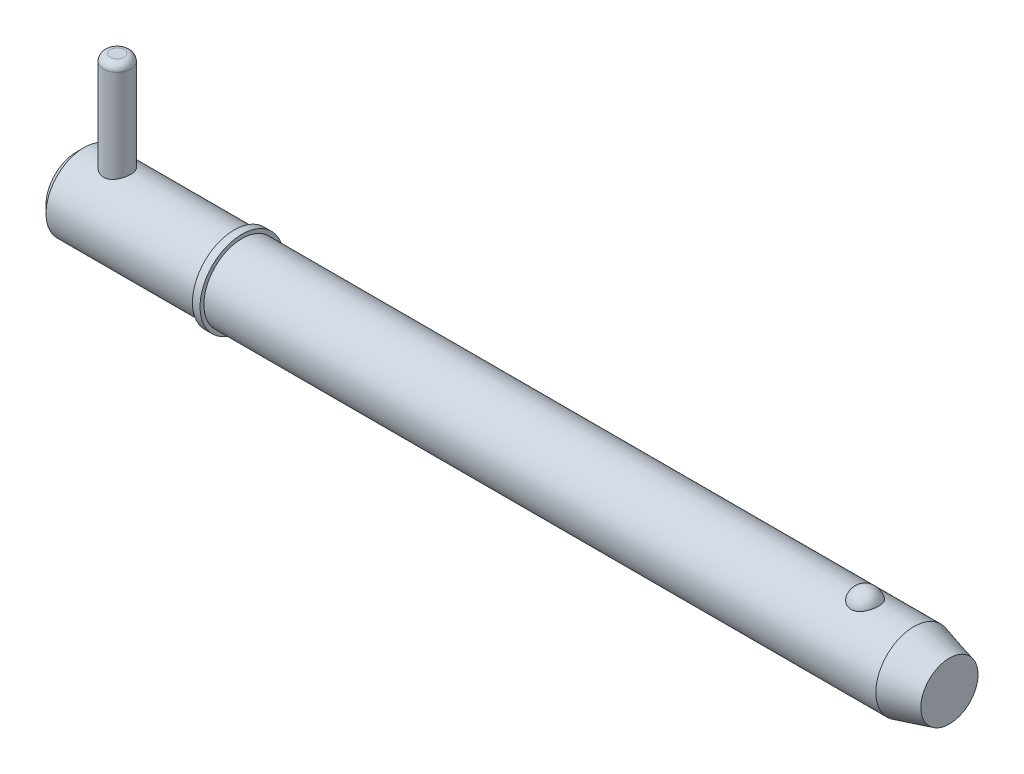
ISO-10303-21;
HEADER;
FILE_DESCRIPTION(('STEP AP214'),'2;1');
FILE_NAME('part.step','',(''),(''),'','','');
FILE_SCHEMA(('AUTOMOTIVE_DESIGN { 1 0 10303 214 1 1 1 1 }'));
ENDSEC;
DATA;
#1=APPLICATION_CONTEXT('core data for automotive mechanical design processes');
#2=APPLICATION_PROTOCOL_DEFINITION('international standard','automotive_design',2000,#1);
#3=PRODUCT_CONTEXT('',#1,'mechanical');
#4=PRODUCT('Part','Part','',(#3));
#5=PRODUCT_RELATED_PRODUCT_CATEGORY('part','',(#4));
#6=PRODUCT_DEFINITION_FORMATION('','',#4);
#7=PRODUCT_DEFINITION_CONTEXT('part definition',#1,'design');
#8=PRODUCT_DEFINITION('design','',#6,#7);
#9=PRODUCT_DEFINITION_SHAPE('','',#8);
#10=(LENGTH_UNIT() NAMED_UNIT(*) SI_UNIT(.MILLI.,.METRE.));
#11=(NAMED_UNIT(*) PLANE_ANGLE_UNIT() SI_UNIT($,.RADIAN.));
#12=(NAMED_UNIT(*) SI_UNIT($,.STERADIAN.) SOLID_ANGLE_UNIT());
#13=UNCERTAINTY_MEASURE_WITH_UNIT(LENGTH_MEASURE(1.E-05),#10,'distance_accuracy_value','');
#14=(GEOMETRIC_REPRESENTATION_CONTEXT(3) GLOBAL_UNCERTAINTY_ASSIGNED_CONTEXT((#13)) GLOBAL_UNIT_ASSIGNED_CONTEXT((#10,
#11,#12)) REPRESENTATION_CONTEXT('',''));
#15=CARTESIAN_POINT('',(0.,0.,0.));
#16=DIRECTION('',(0.,0.,1.));
#17=DIRECTION('',(1.,0.,0.));
#18=AXIS2_PLACEMENT_3D('',#15,#16,#17);
#19=CARTESIAN_POINT('',(5.94,19.845,0.));
#20=DIRECTION('',(0.,-1.,0.));
#21=DIRECTION('',(0.,0.,-1.));
#22=AXIS2_PLACEMENT_3D('',#19,#20,#21);
#23=CYLINDRICAL_SURFACE('',#22,1.98);
#24=CARTESIAN_POINT('',(5.94,-4.565,0.));
#25=DIRECTION('',(0.,1.,0.));
#26=DIRECTION('',(0.,0.,1.));
#27=AXIS2_PLACEMENT_3D('',#24,#25,#26);
#28=CIRCLE('',#27,1.98);
#29=CARTESIAN_POINT('',(5.94,-4.565,1.98));
#30=VERTEX_POINT('',#29);
#31=EDGE_CURVE('P0_E25',#30,#30,#28,.T.);
#32=ORIENTED_EDGE('',*,*,#31,.T.);
#33=EDGE_LOOP('',(#32));
#34=FACE_BOUND('',#33,.T.);
#35=CARTESIAN_POINT('',(5.94,18.855,0.));
#36=DIRECTION('',(0.,1.,0.));
#37=DIRECTION('',(0.,0.,1.));
#38=AXIS2_PLACEMENT_3D('',#35,#36,#37);
#39=CIRCLE('',#38,1.98);
#40=CARTESIAN_POINT('',(5.94,18.855,1.98));
#41=VERTEX_POINT('',#40);
#42=EDGE_CURVE('P0_E29',#41,#41,#39,.F.);
#43=ORIENTED_EDGE('',*,*,#42,.T.);
#44=EDGE_LOOP('',(#43));
#45=FACE_BOUND('',#44,.T.);
#46=ADVANCED_FACE('P0_F14',(#34,#45),#23,.T.);
#47=CARTESIAN_POINT('',(5.94,19.845,0.));
#48=DIRECTION('',(0.,1.,0.));
#49=DIRECTION('',(0.,0.,1.));
#50=AXIS2_PLACEMENT_3D('',#47,#48,#49);
#51=PLANE('',#50);
#52=CARTESIAN_POINT('',(5.94,19.845,0.));
#53=DIRECTION('',(0.,1.,0.));
#54=DIRECTION('',(0.,0.,1.));
#55=AXIS2_PLACEMENT_3D('',#52,#53,#54);
#56=CIRCLE('',#55,0.99);
#57=CARTESIAN_POINT('',(5.94,19.845,0.99));
#58=VERTEX_POINT('',#57);
#59=EDGE_CURVE('P0_E10',#58,#58,#56,.T.);
#60=ORIENTED_EDGE('',*,*,#59,.T.);
#61=EDGE_LOOP('',(#60));
#62=FACE_BOUND('',#61,.T.);
#63=ADVANCED_FACE('P0_F46',(#62),#51,.T.);
#64=CARTESIAN_POINT('',(5.94,-5.555,0.));
#65=DIRECTION('',(0.,1.,0.));
#66=DIRECTION('',(0.,0.,1.));
#67=AXIS2_PLACEMENT_3D('',#64,#65,#66);
#68=PLANE('',#67);
#69=CARTESIAN_POINT('',(5.94,-5.555,0.));
#70=DIRECTION('',(0.,1.,0.));
#71=DIRECTION('',(0.,0.,1.));
#72=AXIS2_PLACEMENT_3D('',#69,#70,#71);
#73=CIRCLE('',#72,0.99);
#74=CARTESIAN_POINT('',(5.94,-5.555,0.99));
#75=VERTEX_POINT('',#74);
#76=EDGE_CURVE('P0_E21',#75,#75,#73,.F.);
#77=ORIENTED_EDGE('',*,*,#76,.T.);
#78=EDGE_LOOP('',(#77));
#79=FACE_BOUND('',#78,.T.);
#80=ADVANCED_FACE('P0_F43',(#79),#68,.F.);
#81=CARTESIAN_POINT('',(5.94,-4.565,0.));
#82=DIRECTION('',(0.,1.,0.));
#83=DIRECTION('',(0.,0.,1.));
#84=AXIS2_PLACEMENT_3D('',#81,#82,#83);
#85=DEGENERATE_TOROIDAL_SURFACE('',#84,0.99,0.99,.T.);
#86=ORIENTED_EDGE('',*,*,#76,.F.);
#87=EDGE_LOOP('',(#86));
#88=FACE_BOUND('',#87,.T.);
#89=ORIENTED_EDGE('',*,*,#31,.F.);
#90=EDGE_LOOP('',(#89));
#91=FACE_BOUND('',#90,.T.);
#92=ADVANCED_FACE('P0_F38',(#88,#91),#85,.T.);
#93=CARTESIAN_POINT('',(5.94,18.855,0.));
#94=DIRECTION('',(0.,1.,0.));
#95=DIRECTION('',(0.,0.,1.));
#96=AXIS2_PLACEMENT_3D('',#93,#94,#95);
#97=DEGENERATE_TOROIDAL_SURFACE('',#96,0.99,0.99,.T.);
#98=ORIENTED_EDGE('',*,*,#42,.F.);
#99=EDGE_LOOP('',(#98));
#100=FACE_BOUND('',#99,.T.);
#101=ORIENTED_EDGE('',*,*,#59,.F.);
#102=EDGE_LOOP('',(#101));
#103=FACE_BOUND('',#102,.T.);
#104=ADVANCED_FACE('P0_F16',(#100,#103),#97,.T.);
#105=CLOSED_SHELL('',(#46,#63,#80,#92,#104));
#106=MANIFOLD_SOLID_BREP('P0_B1',#105);
#107=CARTESIAN_POINT('',(0.,0.,0.));
#108=DIRECTION('',(1.,0.,0.));
#109=DIRECTION('',(0.,0.,-1.));
#110=AXIS2_PLACEMENT_3D('',#107,#108,#109);
#111=CYLINDRICAL_SURFACE('',#110,5.555);
#112=CARTESIAN_POINT('',(122.117114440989,0.,0.));
#113=DIRECTION('',(1.,0.,0.));
#114=DIRECTION('',(0.,0.,-1.));
#115=AXIS2_PLACEMENT_3D('',#112,#113,#114);
#116=CIRCLE('',#115,5.555);
#117=CARTESIAN_POINT('',(122.117114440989,0.,-5.555));
#118=VERTEX_POINT('',#117);
#119=EDGE_CURVE('P1_E81',#118,#118,#116,.T.);
#120=ORIENTED_EDGE('',*,*,#119,.F.);
#121=EDGE_LOOP('',(#120));
#122=FACE_BOUND('',#121,.T.);
#123=CARTESIAN_POINT('',(24.13,0.,0.));
#124=DIRECTION('',(1.,0.,0.));
#125=DIRECTION('',(0.,0.,-1.));
#126=AXIS2_PLACEMENT_3D('',#123,#124,#125);
#127=CIRCLE('',#126,5.555);
#128=CARTESIAN_POINT('',(24.13,0.,-5.555));
#129=VERTEX_POINT('',#128);
#130=EDGE_CURVE('P1_E85',#129,#129,#127,.T.);
#131=ORIENTED_EDGE('',*,*,#130,.T.);
#132=EDGE_LOOP('',(#131));
#133=FACE_BOUND('',#132,.T.);
#134=CARTESIAN_POINT('',(114.998626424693,5.16741224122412,2.03859650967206));
#135=CARTESIAN_POINT('',(114.892949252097,5.16740893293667,2.03859990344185));
#136=CARTESIAN_POINT('',(114.78729894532,5.17079470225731,2.03008306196));
#137=CARTESIAN_POINT('',(114.579141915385,5.18392795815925,1.99630721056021));
#138=CARTESIAN_POINT('',(114.476634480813,5.19367399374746,1.97105201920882));
#139=CARTESIAN_POINT('',(114.277771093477,5.21839168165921,1.90463997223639));
#140=CARTESIAN_POINT('',(114.181406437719,5.23335573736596,1.86350622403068));
#141=CARTESIAN_POINT('',(113.997080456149,5.26688076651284,1.76652592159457));
#142=CARTESIAN_POINT('',(113.909120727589,5.28544242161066,1.71067657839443));
#143=CARTESIAN_POINT('',(113.741265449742,5.32479845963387,1.58399959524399));
#144=CARTESIAN_POINT('',(113.66166564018,5.34564089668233,1.51279545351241));
#145=CARTESIAN_POINT('',(113.51512901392,5.38697258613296,1.3582858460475));
#146=CARTESIAN_POINT('',(113.448194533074,5.40746177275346,1.27497815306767));
#147=CARTESIAN_POINT('',(113.32561039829,5.44694508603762,1.09440293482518));
#148=CARTESIAN_POINT('',(113.270598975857,5.46583143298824,0.996677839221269));
#149=CARTESIAN_POINT('',(113.176937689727,5.49908030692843,0.792961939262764));
#150=CARTESIAN_POINT('',(113.138289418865,5.513442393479,0.686970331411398));
#151=CARTESIAN_POINT('',(113.077680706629,5.536358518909,0.468019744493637));
#152=CARTESIAN_POINT('',(113.055972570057,5.54482455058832,0.354981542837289));
#153=CARTESIAN_POINT('',(113.030636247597,5.55473324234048,0.126595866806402));
#154=CARTESIAN_POINT('',(113.027007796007,5.55617600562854,0.0112484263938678));
#155=CARTESIAN_POINT('',(113.037881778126,5.55189984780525,-0.218011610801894));
#156=CARTESIAN_POINT('',(113.052315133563,5.54620821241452,-0.331928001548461));
#157=CARTESIAN_POINT('',(113.098903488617,5.52828920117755,-0.555544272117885));
#158=CARTESIAN_POINT('',(113.131058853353,5.51606169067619,-0.665244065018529));
#159=CARTESIAN_POINT('',(113.212488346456,5.48630779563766,-0.877469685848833));
#160=CARTESIAN_POINT('',(113.261781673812,5.4687754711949,-0.979987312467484));
#161=CARTESIAN_POINT('',(113.376478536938,5.43024700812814,-1.17486975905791));
#162=CARTESIAN_POINT('',(113.441883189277,5.40925062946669,-1.26723387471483));
#163=CARTESIAN_POINT('',(113.587571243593,5.36600927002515,-1.43940133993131));
#164=CARTESIAN_POINT('',(113.667885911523,5.34376173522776,-1.51917763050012));
#165=CARTESIAN_POINT('',(113.841452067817,5.30057971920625,-1.66360338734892));
#166=CARTESIAN_POINT('',(113.934702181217,5.27964509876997,-1.72825445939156));
#167=CARTESIAN_POINT('',(114.129393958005,5.24205250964,-1.83909478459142));
#168=CARTESIAN_POINT('',(114.230590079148,5.22530519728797,-1.88568407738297));
#169=CARTESIAN_POINT('',(114.440155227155,5.1975091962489,-1.96100802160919));
#170=CARTESIAN_POINT('',(114.548521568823,5.1864583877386,-1.98974931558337));
#171=CARTESIAN_POINT('',(114.763498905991,5.17184410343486,-2.02742262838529));
#172=CARTESIAN_POINT('',(114.869925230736,5.1679328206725,-2.03727608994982));
#173=CARTESIAN_POINT('',(115.082992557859,5.16698995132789,-2.03966777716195));
#174=CARTESIAN_POINT('',(115.189633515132,5.16995704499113,-2.03220932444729));
#175=CARTESIAN_POINT('',(115.396773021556,5.18222383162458,-2.00071170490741));
#176=CARTESIAN_POINT('',(115.497359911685,5.19133213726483,-1.97717337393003));
#177=CARTESIAN_POINT('',(115.693014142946,5.21467637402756,-1.91475248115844));
#178=CARTESIAN_POINT('',(115.788081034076,5.22891272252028,-1.8758686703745));
#179=CARTESIAN_POINT('',(115.972371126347,5.26137066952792,-1.7828271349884));
#180=CARTESIAN_POINT('',(116.061419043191,5.27967329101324,-1.72835124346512));
#181=CARTESIAN_POINT('',(116.229288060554,5.3181741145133,-1.6059748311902));
#182=CARTESIAN_POINT('',(116.308106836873,5.33837274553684,-1.53807126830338));
#183=CARTESIAN_POINT('',(116.457515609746,5.37968287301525,-1.38688970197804));
#184=CARTESIAN_POINT('',(116.527505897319,5.40079011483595,-1.30301744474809));
#185=CARTESIAN_POINT('',(116.653012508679,5.44074401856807,-1.12458170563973));
#186=CARTESIAN_POINT('',(116.708526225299,5.45959027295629,-1.03001630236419));
#187=CARTESIAN_POINT('',(116.805550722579,5.49369849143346,-0.829439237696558));
#188=CARTESIAN_POINT('',(116.846548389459,5.50882422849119,-0.723155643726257));
#189=CARTESIAN_POINT('',(116.911125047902,5.53310911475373,-0.504772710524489));
#190=CARTESIAN_POINT('',(116.934703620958,5.54226812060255,-0.392673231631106));
#191=CARTESIAN_POINT('',(116.964013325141,5.55370358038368,-0.165459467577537));
#192=CARTESIAN_POINT('',(116.969688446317,5.55595843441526,-0.0503368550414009));
#193=CARTESIAN_POINT('',(116.962916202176,5.55329317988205,0.179288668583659));
#194=CARTESIAN_POINT('',(116.950469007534,5.54837313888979,0.293791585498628));
#195=CARTESIAN_POINT('',(116.907779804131,5.53189037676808,0.518526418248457));
#196=CARTESIAN_POINT('',(116.877598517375,5.5203503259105,0.628771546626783));
#197=CARTESIAN_POINT('',(116.800096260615,5.49182453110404,0.842318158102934));
#198=CARTESIAN_POINT('',(116.752774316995,5.47483847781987,0.945619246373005));
#199=CARTESIAN_POINT('',(116.641720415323,5.43710633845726,1.14281571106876));
#200=CARTESIAN_POINT('',(116.577921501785,5.41634501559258,1.23667048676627));
#201=CARTESIAN_POINT('',(116.435357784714,5.37334572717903,1.41185243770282));
#202=CARTESIAN_POINT('',(116.35659323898,5.35110778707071,1.4931798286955));
#203=CARTESIAN_POINT('',(116.186423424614,5.30779474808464,1.64049162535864));
#204=CARTESIAN_POINT('',(116.09510026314,5.28671324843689,1.70656877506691));
#205=CARTESIAN_POINT('',(115.901739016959,5.24804852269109,1.82201372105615));
#206=CARTESIAN_POINT('',(115.799700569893,5.23046541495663,1.87138095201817));
#207=CARTESIAN_POINT('',(115.583618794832,5.20042692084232,1.95335298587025));
#208=CARTESIAN_POINT('',(115.469260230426,5.18820192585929,1.98521734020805));
#209=CARTESIAN_POINT('',(115.236130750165,5.17169804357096,2.02783294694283));
#210=CARTESIAN_POINT('',(115.117361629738,5.16741595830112,2.03859269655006));
#211=CARTESIAN_POINT('',(114.998626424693,5.16741224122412,2.03859650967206));
#212=B_SPLINE_CURVE_WITH_KNOTS('',3,(#134,#135,#136,#137,#138,#139,#140,#141,#142,#143,#144,
#145,#146,#147,#148,#149,#150,#151,#152,#153,#154,#155,#156,#157,#158,#159,#160,#161,#162,#163,
#164,#165,#166,#167,#168,#169,#170,#171,#172,#173,#174,#175,#176,#177,#178,#179,#180,#181,#182,
#183,#184,#185,#186,#187,#188,#189,#190,#191,#192,#193,#194,#195,#196,#197,#198,#199,#200,#201,
#202,#203,#204,#205,#206,#207,#208,#209,#210,#211),.UNSPECIFIED.,.T.,.F.,(4,2,2,2,2,2,2,2,2,2,2,
2,2,2,2,2,2,2,2,2,2,2,2,2,2,2,2,2,2,2,2,2,2,2,2,2,2,2,4),(0.,0.316595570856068,
0.633118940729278,0.949183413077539,1.26530783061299,1.59030762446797,1.91536729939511,
2.25495824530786,2.5945822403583,2.93917283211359,3.28375835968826,3.62703002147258,
3.97030875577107,4.31397329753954,4.65766166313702,5.0020790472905,5.34645984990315,
5.68270547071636,6.01882587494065,6.33808403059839,6.65728093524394,6.96696376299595,
7.27667180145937,7.59321535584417,7.90983070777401,8.24210387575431,8.57443684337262,
8.91755896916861,9.26068933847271,9.60489211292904,9.94909164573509,10.2921194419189,
10.6351667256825,10.9796305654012,11.3240884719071,11.6663928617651,12.0087088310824,
12.3645679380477,12.7202837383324),.UNSPECIFIED.);
#213=CARTESIAN_POINT('',(114.998626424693,5.16741224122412,2.03859650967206));
#214=VERTEX_POINT('',#213);
#215=EDGE_CURVE('P1_E35',#214,#214,#212,.T.);
#216=ORIENTED_EDGE('',*,*,#215,.T.);
#217=EDGE_LOOP('',(#216));
#218=FACE_BOUND('',#217,.T.);
#219=ADVANCED_FACE('P1_F13',(#122,#133,#218),#111,.T.);
#220=CARTESIAN_POINT('',(0.,0.,0.));
#221=DIRECTION('',(-1.,0.,0.));
#222=DIRECTION('',(0.,0.,1.));
#223=AXIS2_PLACEMENT_3D('',#220,#221,#222);
#224=PLANE('',#223);
#225=CARTESIAN_POINT('',(0.,0.,0.));
#226=DIRECTION('',(1.,0.,0.));
#227=DIRECTION('',(0.,0.,-1.));
#228=AXIS2_PLACEMENT_3D('',#225,#226,#227);
#229=CIRCLE('',#228,4.444);
#230=CARTESIAN_POINT('',(0.,0.,-4.444));
#231=VERTEX_POINT('',#230);
#232=EDGE_CURVE('P1_E9',#231,#231,#229,.T.);
#233=ORIENTED_EDGE('',*,*,#232,.F.);
#234=EDGE_LOOP('',(#233));
#235=FACE_BOUND('',#234,.T.);
#236=ADVANCED_FACE('P1_F15',(#235),#224,.T.);
#237=CARTESIAN_POINT('',(1.111,0.,0.));
#238=DIRECTION('',(1.,0.,0.));
#239=DIRECTION('',(0.,0.,-1.));
#240=AXIS2_PLACEMENT_3D('',#237,#238,#239);
#241=CONICAL_SURFACE('',#240,5.555,0.78539816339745);
#242=ORIENTED_EDGE('',*,*,#232,.T.);
#243=EDGE_LOOP('',(#242));
#244=FACE_BOUND('',#243,.T.);
#245=CARTESIAN_POINT('',(1.111,0.,0.));
#246=DIRECTION('',(1.,0.,0.));
#247=DIRECTION('',(0.,0.,-1.));
#248=AXIS2_PLACEMENT_3D('',#245,#246,#247);
#249=CIRCLE('',#248,5.555);
#250=CARTESIAN_POINT('',(1.111,0.,-5.555));
#251=VERTEX_POINT('',#250);
#252=EDGE_CURVE('P1_E26',#251,#251,#249,.T.);
#253=ORIENTED_EDGE('',*,*,#252,.F.);
#254=EDGE_LOOP('',(#253));
#255=FACE_BOUND('',#254,.T.);
#256=ADVANCED_FACE('P1_F77',(#244,#255),#241,.T.);
#257=CARTESIAN_POINT('',(0.,0.,0.));
#258=DIRECTION('',(1.,0.,0.));
#259=DIRECTION('',(0.,0.,-1.));
#260=AXIS2_PLACEMENT_3D('',#257,#258,#259);
#261=CYLINDRICAL_SURFACE('',#260,5.555);
#262=CARTESIAN_POINT('',(5.94,-5.19014691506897,1.98));
#263=CARTESIAN_POINT('',(5.83264687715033,-5.19014494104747,1.98000226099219));
#264=CARTESIAN_POINT('',(5.7253094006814,-5.19351395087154,1.97123988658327));
#265=CARTESIAN_POINT('',(5.51384517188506,-5.20654291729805,1.93656219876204));
#266=CARTESIAN_POINT('',(5.40971858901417,-5.21620320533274,1.91064598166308));
#267=CARTESIAN_POINT('',(5.20778082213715,-5.24058443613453,1.84271148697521));
#268=CARTESIAN_POINT('',(5.10995634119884,-5.25529427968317,1.80072850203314));
#269=CARTESIAN_POINT('',(4.92270352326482,-5.28810012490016,1.70197537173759));
#270=CARTESIAN_POINT('',(4.83327743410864,-5.3061970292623,1.64520128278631));
#271=CARTESIAN_POINT('',(4.66135184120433,-5.34464714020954,1.51575187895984));
#272=CARTESIAN_POINT('',(4.57928277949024,-5.36506222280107,1.44252311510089));
#273=CARTESIAN_POINT('',(4.42829115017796,-5.40532920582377,1.28342047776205));
#274=CARTESIAN_POINT('',(4.35937105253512,-5.42518099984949,1.19754423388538));
#275=CARTESIAN_POINT('',(4.23461605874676,-5.46281133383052,1.01237205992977));
#276=CARTESIAN_POINT('',(4.17924129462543,-5.48050875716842,0.912748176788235));
#277=CARTESIAN_POINT('',(4.0862117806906,-5.51109938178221,0.70485824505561));
#278=CARTESIAN_POINT('',(4.0485515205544,-5.52399407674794,0.596594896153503));
#279=CARTESIAN_POINT('',(3.99350662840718,-5.54308759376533,0.379019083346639));
#280=CARTESIAN_POINT('',(3.97538263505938,-5.54952987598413,0.269915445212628));
#281=CARTESIAN_POINT('',(3.95756405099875,-5.55586205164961,0.0500378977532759));
#282=CARTESIAN_POINT('',(3.95786404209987,-5.55575387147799,-0.060735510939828));
#283=CARTESIAN_POINT('',(3.97643665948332,-5.54915684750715,-0.275539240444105));
#284=CARTESIAN_POINT('',(3.99390415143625,-5.54295384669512,-0.379649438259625));
#285=CARTESIAN_POINT('',(4.0449721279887,-5.52523170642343,-0.583350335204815));
#286=CARTESIAN_POINT('',(4.07857373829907,-5.51371219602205,-0.682940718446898));
#287=CARTESIAN_POINT('',(4.16137312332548,-5.4863099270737,-0.876423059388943));
#288=CARTESIAN_POINT('',(4.2107826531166,-5.47036834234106,-0.970215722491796));
#289=CARTESIAN_POINT('',(4.32361427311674,-5.43575653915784,-1.1484017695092));
#290=CARTESIAN_POINT('',(4.38704062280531,-5.41708549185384,-1.23279228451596));
#291=CARTESIAN_POINT('',(4.53006791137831,-5.37778429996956,-1.39454579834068));
#292=CARTESIAN_POINT('',(4.61035105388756,-5.35710277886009,-1.4712940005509));
#293=CARTESIAN_POINT('',(4.78279835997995,-5.31692766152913,-1.6104545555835));
#294=CARTESIAN_POINT('',(4.874964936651,-5.29743430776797,-1.67286398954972));
#295=CARTESIAN_POINT('',(5.07076688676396,-5.26153775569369,-1.78259698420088));
#296=CARTESIAN_POINT('',(5.17458163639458,-5.24519780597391,-1.8296227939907));
#297=CARTESIAN_POINT('',(5.38938990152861,-5.21818744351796,-1.90530278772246));
#298=CARTESIAN_POINT('',(5.50037985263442,-5.20751423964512,-1.93396601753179));
#299=CARTESIAN_POINT('',(5.72036376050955,-5.19369176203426,-1.97077654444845));
#300=CARTESIAN_POINT('',(5.82917370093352,-5.19018851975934,-1.97989015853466));
#301=CARTESIAN_POINT('',(6.04680100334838,-5.19010609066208,-1.98010779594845));
#302=CARTESIAN_POINT('',(6.15561835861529,-5.19352540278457,-1.97121572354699));
#303=CARTESIAN_POINT('',(6.36548036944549,-5.20654623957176,-1.93654727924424));
#304=CARTESIAN_POINT('',(6.46666051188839,-5.21588705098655,-1.91148218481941));
#305=CARTESIAN_POINT('',(6.66334537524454,-5.23939939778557,-1.84605494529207));
#306=CARTESIAN_POINT('',(6.75884899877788,-5.25357186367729,-1.8056898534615));
#307=CARTESIAN_POINT('',(6.94517989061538,-5.28576258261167,-1.70921153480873));
#308=CARTESIAN_POINT('',(7.03572661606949,-5.30389804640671,-1.65259670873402));
#309=CARTESIAN_POINT('',(7.20638087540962,-5.34176077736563,-1.52577523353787));
#310=CARTESIAN_POINT('',(7.28648490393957,-5.36148857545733,-1.45556404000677));
#311=CARTESIAN_POINT('',(7.43864697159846,-5.40165494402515,-1.2988614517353));
#312=CARTESIAN_POINT('',(7.50999887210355,-5.42207106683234,-1.21167640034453));
#313=CARTESIAN_POINT('',(7.63712639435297,-5.46023601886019,-1.026066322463));
#314=CARTESIAN_POINT('',(7.69290228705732,-5.47798489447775,-0.927641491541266));
#315=CARTESIAN_POINT('',(7.78684673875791,-5.50876590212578,-0.722633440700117));
#316=CARTESIAN_POINT('',(7.82510508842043,-5.52182201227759,-0.616095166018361));
#317=CARTESIAN_POINT('',(7.88297051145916,-5.54184206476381,-0.397530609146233));
#318=CARTESIAN_POINT('',(7.90258540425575,-5.5488085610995,-0.285506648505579));
#319=CARTESIAN_POINT('',(7.9218262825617,-5.55564472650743,-0.065566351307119));
#320=CARTESIAN_POINT('',(7.92245987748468,-5.55587212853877,0.0422515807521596));
#321=CARTESIAN_POINT('',(7.90626329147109,-5.55011340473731,0.256387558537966));
#322=CARTESIAN_POINT('',(7.88943488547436,-5.54412791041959,0.362705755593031));
#323=CARTESIAN_POINT('',(7.83948457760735,-5.52676548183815,0.568649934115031));
#324=CARTESIAN_POINT('',(7.8067003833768,-5.51550046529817,0.668367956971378));
#325=CARTESIAN_POINT('',(7.72609369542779,-5.48874437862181,0.860911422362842));
#326=CARTESIAN_POINT('',(7.67826838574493,-5.47325251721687,0.953735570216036));
#327=CARTESIAN_POINT('',(7.56675024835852,-5.43884382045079,1.13391068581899));
#328=CARTESIAN_POINT('',(7.50249968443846,-5.41981485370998,1.22089468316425));
#329=CARTESIAN_POINT('',(7.36086495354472,-5.38069275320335,1.38316665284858));
#330=CARTESIAN_POINT('',(7.28347630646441,-5.36059925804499,1.45845061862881));
#331=CARTESIAN_POINT('',(7.11347587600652,-5.32048380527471,1.59876646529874));
#332=CARTESIAN_POINT('',(7.02032386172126,-5.30050854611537,1.66315951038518));
#333=CARTESIAN_POINT('',(6.82388804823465,-5.26398994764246,1.77536801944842));
#334=CARTESIAN_POINT('',(6.7206049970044,-5.24744635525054,1.82318470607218));
#335=CARTESIAN_POINT('',(6.50639706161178,-5.21987969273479,1.90068230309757));
#336=CARTESIAN_POINT('',(6.3954529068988,-5.20887116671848,1.93031547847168));
#337=CARTESIAN_POINT('',(6.16966522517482,-5.19400760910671,1.96996824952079));
#338=CARTESIAN_POINT('',(6.05482366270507,-5.19014902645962,1.97999758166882));
#339=CARTESIAN_POINT('',(5.94,-5.19014691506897,1.98));
#340=B_SPLINE_CURVE_WITH_KNOTS('',3,(#262,#263,#264,#265,#266,#267,#268,#269,#270,#271,#272,
#273,#274,#275,#276,#277,#278,#279,#280,#281,#282,#283,#284,#285,#286,#287,#288,#289,#290,#291,
#292,#293,#294,#295,#296,#297,#298,#299,#300,#301,#302,#303,#304,#305,#306,#307,#308,#309,#310,
#311,#312,#313,#314,#315,#316,#317,#318,#319,#320,#321,#322,#323,#324,#325,#326,#327,#328,#329,
#330,#331,#332,#333,#334,#335,#336,#337,#338,#339),.UNSPECIFIED.,.T.,.F.,(4,2,2,2,2,2,2,2,2,2,2,
2,2,2,2,2,2,2,2,2,2,2,2,2,2,2,2,2,2,2,2,2,2,2,2,2,2,2,4),(0.,0.321632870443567,
0.643282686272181,0.964229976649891,1.28526292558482,1.61937087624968,1.9535415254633,
2.29784481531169,2.64204093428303,2.97269632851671,3.30325448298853,3.61901541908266,
3.93479838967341,4.25500220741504,4.57530346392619,4.91268648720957,5.25013812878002,
5.59378026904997,5.93725299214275,6.26331481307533,6.58930593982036,6.90185604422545,
7.21446637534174,7.53801472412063,7.86167140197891,8.20353561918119,8.54539388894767,
8.88547970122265,9.22542281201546,9.54728637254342,9.86911722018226,10.1844146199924,
10.4997710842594,10.827730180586,11.1558013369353,11.499115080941,11.8424034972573,
12.1865892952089,12.5306041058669),.UNSPECIFIED.);
#341=CARTESIAN_POINT('',(5.94,-5.19014691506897,1.98));
#342=VERTEX_POINT('',#341);
#343=EDGE_CURVE('P1_E17',#342,#342,#340,.T.);
#344=ORIENTED_EDGE('',*,*,#343,.F.);
#345=EDGE_LOOP('',(#344));
#346=FACE_BOUND('',#345,.T.);
#347=CARTESIAN_POINT('',(5.94,5.19014691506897,1.98));
#348=CARTESIAN_POINT('',(6.04735312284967,5.19014494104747,1.98000226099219));
#349=CARTESIAN_POINT('',(6.1546905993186,5.19351395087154,1.97123988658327));
#350=CARTESIAN_POINT('',(6.36615482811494,5.20654291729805,1.93656219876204));
#351=CARTESIAN_POINT('',(6.47028141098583,5.21620320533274,1.91064598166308));
#352=CARTESIAN_POINT('',(6.67221917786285,5.24058443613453,1.84271148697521));
#353=CARTESIAN_POINT('',(6.77004365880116,5.25529427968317,1.80072850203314));
#354=CARTESIAN_POINT('',(6.95729647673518,5.28810012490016,1.70197537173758));
#355=CARTESIAN_POINT('',(7.04672256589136,5.3061970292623,1.64520128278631));
#356=CARTESIAN_POINT('',(7.21864815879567,5.34464714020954,1.51575187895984));
#357=CARTESIAN_POINT('',(7.30071722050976,5.36506222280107,1.44252311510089));
#358=CARTESIAN_POINT('',(7.45170884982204,5.40532920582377,1.28342047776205));
#359=CARTESIAN_POINT('',(7.52062894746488,5.42518099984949,1.19754423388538));
#360=CARTESIAN_POINT('',(7.64538394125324,5.46281133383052,1.01237205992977));
#361=CARTESIAN_POINT('',(7.70075870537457,5.48050875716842,0.912748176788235));
#362=CARTESIAN_POINT('',(7.7937882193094,5.51109938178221,0.704858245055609));
#363=CARTESIAN_POINT('',(7.8314484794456,5.52399407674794,0.596594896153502));
#364=CARTESIAN_POINT('',(7.88649337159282,5.54308759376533,0.379019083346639));
#365=CARTESIAN_POINT('',(7.90461736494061,5.54952987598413,0.269915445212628));
#366=CARTESIAN_POINT('',(7.92243594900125,5.55586205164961,0.0500378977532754));
#367=CARTESIAN_POINT('',(7.92213595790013,5.55575387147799,-0.0607355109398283));
#368=CARTESIAN_POINT('',(7.90356334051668,5.54915684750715,-0.275539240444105));
#369=CARTESIAN_POINT('',(7.88609584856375,5.54295384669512,-0.379649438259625));
#370=CARTESIAN_POINT('',(7.8350278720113,5.52523170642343,-0.583350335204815));
#371=CARTESIAN_POINT('',(7.80142626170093,5.51371219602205,-0.682940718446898));
#372=CARTESIAN_POINT('',(7.71862687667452,5.4863099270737,-0.876423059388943));
#373=CARTESIAN_POINT('',(7.6692173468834,5.47036834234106,-0.970215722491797));
#374=CARTESIAN_POINT('',(7.55638572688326,5.43575653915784,-1.1484017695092));
#375=CARTESIAN_POINT('',(7.49295937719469,5.41708549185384,-1.23279228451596));
#376=CARTESIAN_POINT('',(7.34993208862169,5.37778429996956,-1.39454579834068));
#377=CARTESIAN_POINT('',(7.26964894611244,5.35710277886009,-1.4712940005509));
#378=CARTESIAN_POINT('',(7.09720164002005,5.31692766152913,-1.6104545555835));
#379=CARTESIAN_POINT('',(7.00503506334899,5.29743430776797,-1.67286398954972));
#380=CARTESIAN_POINT('',(6.80923311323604,5.26153775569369,-1.78259698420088));
#381=CARTESIAN_POINT('',(6.70541836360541,5.24519780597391,-1.8296227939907));
#382=CARTESIAN_POINT('',(6.49061009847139,5.21818744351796,-1.90530278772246));
#383=CARTESIAN_POINT('',(6.37962014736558,5.20751423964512,-1.93396601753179));
#384=CARTESIAN_POINT('',(6.15963623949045,5.19369176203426,-1.97077654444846));
#385=CARTESIAN_POINT('',(6.05082629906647,5.19018851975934,-1.97989015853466));
#386=CARTESIAN_POINT('',(5.83319899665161,5.19010609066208,-1.98010779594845));
#387=CARTESIAN_POINT('',(5.7243816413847,5.19352540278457,-1.97121572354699));
#388=CARTESIAN_POINT('',(5.5145196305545,5.20654623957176,-1.93654727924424));
#389=CARTESIAN_POINT('',(5.4133394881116,5.21588705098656,-1.91148218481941));
#390=CARTESIAN_POINT('',(5.21665462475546,5.23939939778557,-1.84605494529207));
#391=CARTESIAN_POINT('',(5.12115100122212,5.25357186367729,-1.8056898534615));
#392=CARTESIAN_POINT('',(4.93482010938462,5.28576258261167,-1.70921153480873));
#393=CARTESIAN_POINT('',(4.84427338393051,5.30389804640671,-1.65259670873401));
#394=CARTESIAN_POINT('',(4.67361912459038,5.34176077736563,-1.52577523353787));
#395=CARTESIAN_POINT('',(4.59351509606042,5.36148857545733,-1.45556404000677));
#396=CARTESIAN_POINT('',(4.44135302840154,5.40165494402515,-1.2988614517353));
#397=CARTESIAN_POINT('',(4.37000112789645,5.42207106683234,-1.21167640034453));
#398=CARTESIAN_POINT('',(4.24287360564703,5.46023601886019,-1.026066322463));
#399=CARTESIAN_POINT('',(4.18709771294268,5.47798489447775,-0.927641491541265));
#400=CARTESIAN_POINT('',(4.09315326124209,5.50876590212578,-0.722633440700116));
#401=CARTESIAN_POINT('',(4.05489491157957,5.52182201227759,-0.61609516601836));
#402=CARTESIAN_POINT('',(3.99702948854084,5.54184206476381,-0.397530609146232));
#403=CARTESIAN_POINT('',(3.97741459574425,5.5488085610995,-0.285506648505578));
#404=CARTESIAN_POINT('',(3.9581737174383,5.55564472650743,-0.0655663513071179));
#405=CARTESIAN_POINT('',(3.95754012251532,5.55587212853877,0.0422515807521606));
#406=CARTESIAN_POINT('',(3.97373670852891,5.55011340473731,0.256387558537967));
#407=CARTESIAN_POINT('',(3.99056511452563,5.54412791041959,0.362705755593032));
#408=CARTESIAN_POINT('',(4.04051542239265,5.52676548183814,0.568649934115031));
#409=CARTESIAN_POINT('',(4.07329961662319,5.51550046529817,0.668367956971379));
#410=CARTESIAN_POINT('',(4.15390630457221,5.48874437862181,0.860911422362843));
#411=CARTESIAN_POINT('',(4.20173161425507,5.47325251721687,0.953735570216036));
#412=CARTESIAN_POINT('',(4.31324975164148,5.43884382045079,1.13391068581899));
#413=CARTESIAN_POINT('',(4.37750031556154,5.41981485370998,1.22089468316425));
#414=CARTESIAN_POINT('',(4.51913504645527,5.38069275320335,1.38316665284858));
#415=CARTESIAN_POINT('',(4.59652369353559,5.36059925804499,1.45845061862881));
#416=CARTESIAN_POINT('',(4.76652412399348,5.32048380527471,1.59876646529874));
#417=CARTESIAN_POINT('',(4.85967613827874,5.30050854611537,1.66315951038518));
#418=CARTESIAN_POINT('',(5.05611195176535,5.26398994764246,1.77536801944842));
#419=CARTESIAN_POINT('',(5.1593950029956,5.24744635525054,1.82318470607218));
#420=CARTESIAN_POINT('',(5.37360293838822,5.21987969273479,1.90068230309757));
#421=CARTESIAN_POINT('',(5.4845470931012,5.20887116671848,1.93031547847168));
#422=CARTESIAN_POINT('',(5.71033477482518,5.19400760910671,1.96996824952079));
#423=CARTESIAN_POINT('',(5.82517633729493,5.19014902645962,1.97999758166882));
#424=CARTESIAN_POINT('',(5.94,5.19014691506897,1.98));
#425=B_SPLINE_CURVE_WITH_KNOTS('',3,(#347,#348,#349,#350,#351,#352,#353,#354,#355,#356,#357,
#358,#359,#360,#361,#362,#363,#364,#365,#366,#367,#368,#369,#370,#371,#372,#373,#374,#375,#376,
#377,#378,#379,#380,#381,#382,#383,#384,#385,#386,#387,#388,#389,#390,#391,#392,#393,#394,#395,
#396,#397,#398,#399,#400,#401,#402,#403,#404,#405,#406,#407,#408,#409,#410,#411,#412,#413,#414,
#415,#416,#417,#418,#419,#420,#421,#422,#423,#424),.UNSPECIFIED.,.T.,.F.,(4,2,2,2,2,2,2,2,2,2,2,
2,2,2,2,2,2,2,2,2,2,2,2,2,2,2,2,2,2,2,2,2,2,2,2,2,2,2,4),(0.,0.321632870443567,
0.643282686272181,0.964229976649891,1.28526292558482,1.61937087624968,1.9535415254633,
2.29784481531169,2.64204093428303,2.97269632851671,3.30325448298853,3.61901541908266,
3.93479838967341,4.25500220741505,4.57530346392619,4.91268648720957,5.25013812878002,
5.59378026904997,5.93725299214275,6.26331481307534,6.58930593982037,6.90185604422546,
7.21446637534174,7.53801472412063,7.86167140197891,8.20353561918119,8.54539388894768,
8.88547970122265,9.22542281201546,9.54728637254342,9.86911722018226,10.1844146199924,
10.4997710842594,10.827730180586,11.1558013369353,11.499115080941,11.8424034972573,
12.1865892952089,12.5306041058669),.UNSPECIFIED.);
#426=CARTESIAN_POINT('',(5.94,5.19014691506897,1.98));
#427=VERTEX_POINT('',#426);
#428=EDGE_CURVE('P1_E43',#427,#427,#425,.T.);
#429=ORIENTED_EDGE('',*,*,#428,.F.);
#430=EDGE_LOOP('',(#429));
#431=FACE_BOUND('',#430,.T.);
#432=ORIENTED_EDGE('',*,*,#252,.T.);
#433=EDGE_LOOP('',(#432));
#434=FACE_BOUND('',#433,.T.);
#435=CARTESIAN_POINT('',(23.019,0.,0.));
#436=DIRECTION('',(1.,0.,0.));
#437=DIRECTION('',(0.,0.,-1.));
#438=AXIS2_PLACEMENT_3D('',#435,#436,#437);
#439=CIRCLE('',#438,5.555);
#440=CARTESIAN_POINT('',(23.019,0.,-5.555));
#441=VERTEX_POINT('',#440);
#442=EDGE_CURVE('P1_E31',#441,#441,#439,.T.);
#443=ORIENTED_EDGE('',*,*,#442,.F.);
#444=EDGE_LOOP('',(#443));
#445=FACE_BOUND('',#444,.T.);
#446=ADVANCED_FACE('P1_F103',(#346,#431,#434,#445),#261,.T.);
#447=CARTESIAN_POINT('',(23.019,5.555,0.));
#448=DIRECTION('',(-1.,0.,0.));
#449=DIRECTION('',(0.,0.,1.));
#450=AXIS2_PLACEMENT_3D('',#447,#448,#449);
#451=PLANE('',#450);
#452=ORIENTED_EDGE('',*,*,#442,.T.);
#453=EDGE_LOOP('',(#452));
#454=FACE_BOUND('',#453,.T.);
#455=CARTESIAN_POINT('',(23.019,0.,0.));
#456=DIRECTION('',(1.,0.,0.));
#457=DIRECTION('',(0.,0.,-1.));
#458=AXIS2_PLACEMENT_3D('',#455,#456,#457);
#459=CIRCLE('',#458,6.1105);
#460=CARTESIAN_POINT('',(23.019,0.,-6.1105));
#461=VERTEX_POINT('',#460);
#462=EDGE_CURVE('P1_E91',#461,#461,#459,.T.);
#463=ORIENTED_EDGE('',*,*,#462,.F.);
#464=EDGE_LOOP('',(#463));
#465=FACE_BOUND('',#464,.T.);
#466=ADVANCED_FACE('P1_F100',(#454,#465),#451,.T.);
#467=CARTESIAN_POINT('',(0.,0.,0.));
#468=DIRECTION('',(1.,0.,0.));
#469=DIRECTION('',(0.,0.,-1.));
#470=AXIS2_PLACEMENT_3D('',#467,#468,#469);
#471=CYLINDRICAL_SURFACE('',#470,6.1105);
#472=ORIENTED_EDGE('',*,*,#462,.T.);
#473=EDGE_LOOP('',(#472));
#474=FACE_BOUND('',#473,.T.);
#475=CARTESIAN_POINT('',(24.13,0.,0.));
#476=DIRECTION('',(1.,0.,0.));
#477=DIRECTION('',(0.,0.,-1.));
#478=AXIS2_PLACEMENT_3D('',#475,#476,#477);
#479=CIRCLE('',#478,6.1105);
#480=CARTESIAN_POINT('',(24.13,0.,-6.1105));
#481=VERTEX_POINT('',#480);
#482=EDGE_CURVE('P1_E88',#481,#481,#479,.T.);
#483=ORIENTED_EDGE('',*,*,#482,.F.);
#484=EDGE_LOOP('',(#483));
#485=FACE_BOUND('',#484,.T.);
#486=ADVANCED_FACE('P1_F68',(#474,#485),#471,.T.);
#487=CARTESIAN_POINT('',(24.13,6.1105,0.));
#488=DIRECTION('',(1.,0.,0.));
#489=DIRECTION('',(0.,0.,-1.));
#490=AXIS2_PLACEMENT_3D('',#487,#488,#489);
#491=PLANE('',#490);
#492=ORIENTED_EDGE('',*,*,#482,.T.);
#493=EDGE_LOOP('',(#492));
#494=FACE_BOUND('',#493,.T.);
#495=ORIENTED_EDGE('',*,*,#130,.F.);
#496=EDGE_LOOP('',(#495));
#497=FACE_BOUND('',#496,.T.);
#498=ADVANCED_FACE('P1_F62',(#494,#497),#491,.T.);
#499=CARTESIAN_POINT('',(127.3,0.,0.));
#500=DIRECTION('',(-1.,0.,0.));
#501=DIRECTION('',(0.,0.,1.));
#502=AXIS2_PLACEMENT_3D('',#499,#500,#501);
#503=CONICAL_SURFACE('',#502,4.16625000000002,0.26179938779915);
#504=ORIENTED_EDGE('',*,*,#119,.T.);
#505=EDGE_LOOP('',(#504));
#506=FACE_BOUND('',#505,.T.);
#507=CARTESIAN_POINT('',(127.3,0.,0.));
#508=DIRECTION('',(1.,0.,0.));
#509=DIRECTION('',(0.,0.,-1.));
#510=AXIS2_PLACEMENT_3D('',#507,#508,#509);
#511=CIRCLE('',#510,4.16625000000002);
#512=CARTESIAN_POINT('',(127.3,0.,-4.16625000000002));
#513=VERTEX_POINT('',#512);
#514=EDGE_CURVE('P1_E42',#513,#513,#511,.T.);
#515=ORIENTED_EDGE('',*,*,#514,.F.);
#516=EDGE_LOOP('',(#515));
#517=FACE_BOUND('',#516,.T.);
#518=ADVANCED_FACE('P1_F59',(#506,#517),#503,.T.);
#519=CARTESIAN_POINT('',(127.3,4.16625000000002,0.));
#520=DIRECTION('',(1.,0.,0.));
#521=DIRECTION('',(0.,0.,-1.));
#522=AXIS2_PLACEMENT_3D('',#519,#520,#521);
#523=PLANE('',#522);
#524=ORIENTED_EDGE('',*,*,#514,.T.);
#525=EDGE_LOOP('',(#524));
#526=FACE_BOUND('',#525,.T.);
#527=ADVANCED_FACE('P1_F55',(#526),#523,.T.);
#528=CARTESIAN_POINT('',(114.998626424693,4.9995,0.));
#529=DIRECTION('',(-1.,0.,0.));
#530=DIRECTION('',(0.,1.,0.));
#531=AXIS2_PLACEMENT_3D('',#528,#529,#530);
#532=SPHERICAL_SURFACE('',#531,2.04550000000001);
#533=ORIENTED_EDGE('',*,*,#215,.F.);
#534=EDGE_LOOP('',(#533));
#535=FACE_BOUND('',#534,.T.);
#536=ADVANCED_FACE('P1_F50',(#535),#532,.T.);
#537=CARTESIAN_POINT('',(5.94,-6.1105,0.));
#538=DIRECTION('',(0.,1.,0.));
#539=DIRECTION('',(0.,0.,1.));
#540=AXIS2_PLACEMENT_3D('',#537,#538,#539);
#541=CYLINDRICAL_SURFACE('',#540,1.98);
#542=ORIENTED_EDGE('',*,*,#343,.T.);
#543=EDGE_LOOP('',(#542));
#544=FACE_BOUND('',#543,.T.);
#545=ORIENTED_EDGE('',*,*,#428,.T.);
#546=EDGE_LOOP('',(#545));
#547=FACE_BOUND('',#546,.T.);
#548=ADVANCED_FACE('P1_F54',(#544,#547),#541,.F.);
#549=CLOSED_SHELL('',(#219,#236,#256,#446,#466,#486,#498,#518,#527,#536,#548));
#550=MANIFOLD_SOLID_BREP('P1_B1',#549);
#551=ADVANCED_BREP_SHAPE_REPRESENTATION('',(#18,#106,#550),#14);
#552=SHAPE_DEFINITION_REPRESENTATION(#9,#551);
ENDSEC;
END-ISO-10303-21;
